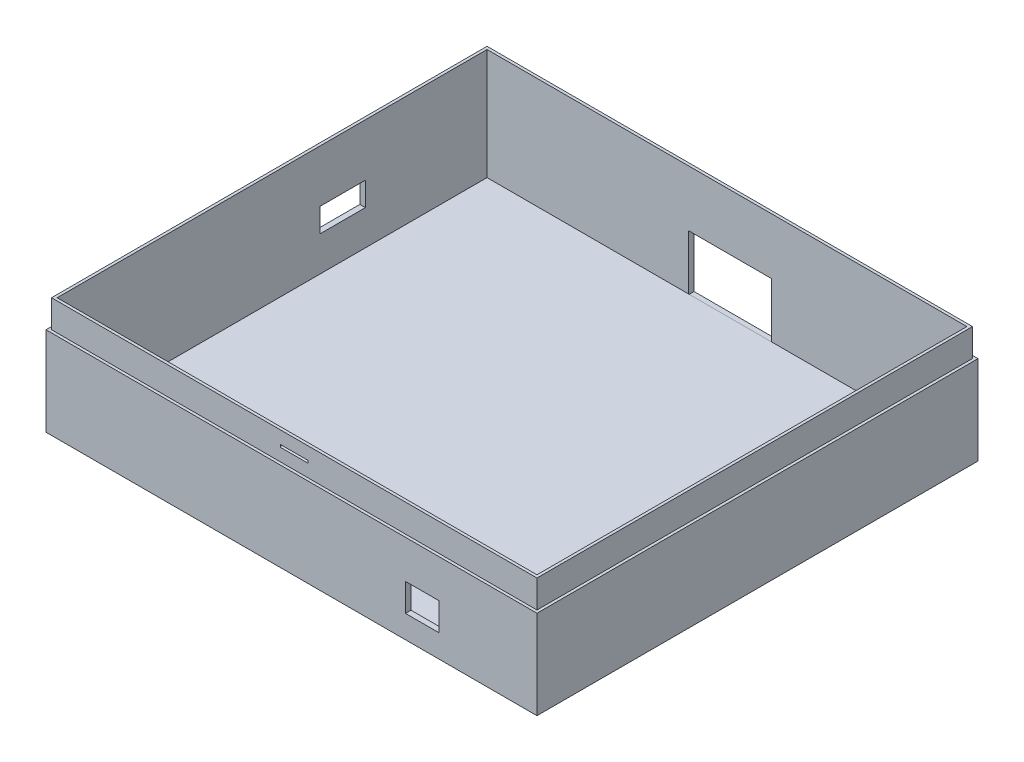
from build123d import *

# Parameters (mm, degrees)
SKETCH_1_W          = 173
SKETCH_1_H          = 155
EXTRUDE_1_DEPTH     = 2
SKETCH_2_W          = 177
SKETCH_2_H          = 159
SKETCH_2_W_2        = 173
SKETCH_2_H_2        = 155
EXTRUDE_2_DEPTH     = 40
SKETCH_3_W          = 177
SKETCH_3_H          = 159
EXTRUDE_3_DEPTH     = 2
SKETCH_4_W          = 30
SKETCH_4_H          = 20
CUT_EXTRUDE_1_DEPTH = 21
CUT_EXTRUDE_2_DEPTH = 10
CUT_EXTRUDE_5_DEPTH = 5
SKETCH_11_W         = 16.6
SKETCH_11_H         = 8.851953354
CUT_EXTRUDE_6_DEPTH = 5
SKETCH_13_W         = 12
SKETCH_13_H         = 10
CUT_EXTRUDE_7_DEPTH = 5
SKETCH_14_W         = 16.6
SKETCH_14_H         = 8.851953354
EXTRUDE_4_DEPTH     = 2
SKETCH_15_W         = 16.3
SKETCH_15_H         = 8.568353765
CUT_EXTRUDE_8_DEPTH = 2


with BuildPart() as part:
    # Sketch 1 → Extrude 1 (new body)
    with BuildSketch(Plane(origin=(0, 0, 0), x_dir=(1, 0, 0), z_dir=(0, 1, 0))):
        with Locations((86.5, 77.5)):
            Rectangle(SKETCH_1_W, SKETCH_1_H)
    extrude(amount=EXTRUDE_1_DEPTH)



with BuildPart() as body_2:
    # Sketch 2 → Extrude 2 (new body)
    with BuildSketch(Plane(origin=(0, 2, 0), x_dir=(1, 0, 0), z_dir=(0, 1, 0))):
        with Locations((86.5, 77.5)):
            Rectangle(SKETCH_2_W, SKETCH_2_H)
        with Locations((86.5, 77.5)):
            Rectangle(SKETCH_2_W_2, SKETCH_2_H_2, mode=Mode.SUBTRACT)
    extrude(amount=EXTRUDE_2_DEPTH)


with BuildPart() as part_1:
    add(part.part)

    add(body_2.part)  # Extrude 3 merges body 2
    # Sketch 3 → Extrude 3 (add)
    with BuildSketch(Plane.XZ):
        with Locations((86.5, -77.5)):
            Rectangle(SKETCH_3_W, SKETCH_3_H)
    extrude(amount=-EXTRUDE_3_DEPTH)

    # Sketch 4 → Cut-Extrude 1 (cut)
    with BuildSketch(Plane.XY.offset(-155)):
        with Locations((87.635164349, 11.755403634)):
            Rectangle(SKETCH_4_W, SKETCH_4_H)
    extrude(amount=-CUT_EXTRUDE_1_DEPTH, mode=Mode.SUBTRACT)

    # Sketch 5 → Cut-Extrude 2 (cut)
    with BuildSketch(Plane(origin=(0, 42, 0), x_dir=(1, 0, 0), z_dir=(0, 1, 0))):
        Polygon((173.886792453, -1), (175, -2), (175, 157), (-2, 157), (-0.886792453, 156), (174, 156), (174, -1), align=None)
        Polygon((-2, -2), (175, -2), (173.886792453, -1), (-1, -1), (-1, 156), (-0.886792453, 156), (-2, 157), align=None)
    extrude(amount=-CUT_EXTRUDE_2_DEPTH, mode=Mode.SUBTRACT)

    # Sketch 8 → Cut-Extrude 5 (cut, symmetric)
    with BuildSketch(Plane.ZY.offset(-86.5)):
        Polygon((-156, 37), (-156, 37.44), (-155.56, 37), (-156, 36.56), align=None)
    cut_extrude_5 = extrude(amount=CUT_EXTRUDE_5_DEPTH, both=True, mode=Mode.SUBTRACT)

    # Mirror 1: Cut-Extrude 5 across plane
    add(cut_extrude_5.mirror(Plane.XY.offset(-77.5)), mode=Mode.SUBTRACT)

    # Sketch 11 → Cut-Extrude 6 (cut)
    with BuildSketch(Plane.ZY.offset(2)):
        with Locations((-103.003651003, 19)):
            Rectangle(SKETCH_11_W, SKETCH_11_H)
    extrude(amount=-CUT_EXTRUDE_6_DEPTH, mode=Mode.SUBTRACT)

    # Sketch 13 → Cut-Extrude 7 (cut)
    with BuildSketch(Plane.XY.offset(2)):
        with Locations((133.606016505, 13.240243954)):
            Rectangle(SKETCH_13_W, SKETCH_13_H)
    extrude(amount=-CUT_EXTRUDE_7_DEPTH, mode=Mode.SUBTRACT)

    # Sketch 14 → Extrude 4 (add)
    with BuildSketch(Plane.ZY.offset(2)):
        with Locations((-103.003651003, 19)):
            Rectangle(SKETCH_14_W, SKETCH_14_H)
    extrude(amount=-EXTRUDE_4_DEPTH)

    # Sketch 15 → Cut-Extrude 8 (cut)
    with BuildSketch(Plane.ZY.offset(2)):
        with Locations((-103.003651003, 18.843440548)):
            Rectangle(SKETCH_15_W, SKETCH_15_H)
    extrude(amount=-CUT_EXTRUDE_8_DEPTH, mode=Mode.SUBTRACT)


solid = part_1.part
